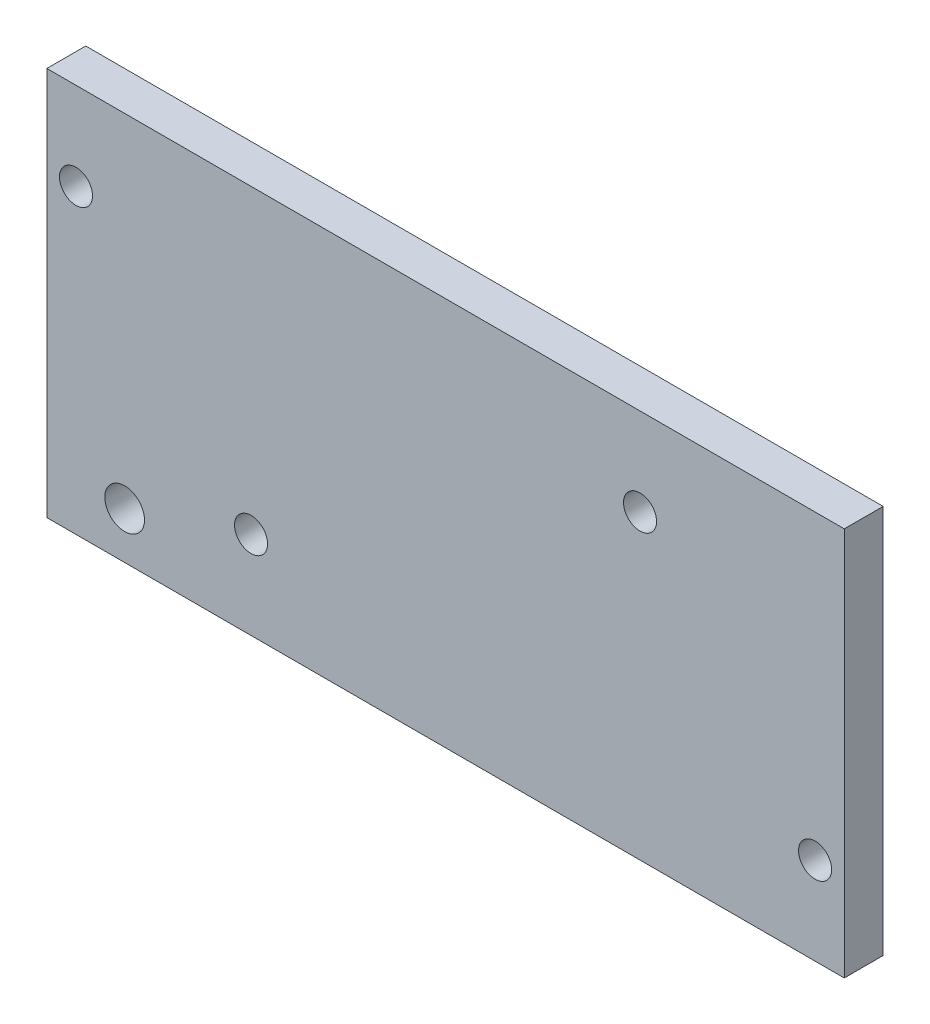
ISO-10303-21;
HEADER;
FILE_DESCRIPTION(('STEP AP214'),'2;1');
FILE_NAME('part.step','',(''),(''),'','','');
FILE_SCHEMA(('AUTOMOTIVE_DESIGN { 1 0 10303 214 1 1 1 1 }'));
ENDSEC;
DATA;
#1=APPLICATION_CONTEXT('core data for automotive mechanical design processes');
#2=APPLICATION_PROTOCOL_DEFINITION('international standard','automotive_design',2000,#1);
#3=PRODUCT_CONTEXT('',#1,'mechanical');
#4=PRODUCT('Part','Part','',(#3));
#5=PRODUCT_RELATED_PRODUCT_CATEGORY('part','',(#4));
#6=PRODUCT_DEFINITION_FORMATION('','',#4);
#7=PRODUCT_DEFINITION_CONTEXT('part definition',#1,'design');
#8=PRODUCT_DEFINITION('design','',#6,#7);
#9=PRODUCT_DEFINITION_SHAPE('','',#8);
#10=(LENGTH_UNIT() NAMED_UNIT(*) SI_UNIT(.MILLI.,.METRE.));
#11=(NAMED_UNIT(*) PLANE_ANGLE_UNIT() SI_UNIT($,.RADIAN.));
#12=(NAMED_UNIT(*) SI_UNIT($,.STERADIAN.) SOLID_ANGLE_UNIT());
#13=UNCERTAINTY_MEASURE_WITH_UNIT(LENGTH_MEASURE(1.E-05),#10,'distance_accuracy_value','');
#14=(GEOMETRIC_REPRESENTATION_CONTEXT(3) GLOBAL_UNCERTAINTY_ASSIGNED_CONTEXT((#13)) GLOBAL_UNIT_ASSIGNED_CONTEXT((#10,
#11,#12)) REPRESENTATION_CONTEXT('',''));
#15=CARTESIAN_POINT('',(0.,0.,0.));
#16=DIRECTION('',(0.,0.,1.));
#17=DIRECTION('',(1.,0.,0.));
#18=AXIS2_PLACEMENT_3D('',#15,#16,#17);
#19=CARTESIAN_POINT('',(205.,0.,0.));
#20=DIRECTION('',(0.,0.,-1.));
#21=DIRECTION('',(-1.,0.,0.));
#22=AXIS2_PLACEMENT_3D('',#19,#20,#21);
#23=PLANE('',#22);
#24=CARTESIAN_POINT('',(20.,12.,0.));
#25=DIRECTION('',(0.,0.,1.));
#26=DIRECTION('',(1.,0.,0.));
#27=AXIS2_PLACEMENT_3D('',#24,#25,#26);
#28=CIRCLE('',#27,5.1);
#29=CARTESIAN_POINT('',(25.1,12.,0.));
#30=VERTEX_POINT('',#29);
#31=EDGE_CURVE('E151',#30,#30,#28,.T.);
#32=ORIENTED_EDGE('',*,*,#31,.F.);
#33=EDGE_LOOP('',(#32));
#34=FACE_BOUND('',#33,.T.);
#35=CARTESIAN_POINT('',(7.50000000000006,77.5,0.));
#36=DIRECTION('',(0.,0.,1.));
#37=DIRECTION('',(1.,0.,0.));
#38=AXIS2_PLACEMENT_3D('',#35,#36,#37);
#39=CIRCLE('',#38,4.25);
#40=CARTESIAN_POINT('',(11.7500000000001,77.5,0.));
#41=VERTEX_POINT('',#40);
#42=EDGE_CURVE('E155',#41,#41,#39,.T.);
#43=ORIENTED_EDGE('',*,*,#42,.F.);
#44=EDGE_LOOP('',(#43));
#45=FACE_BOUND('',#44,.T.);
#46=CARTESIAN_POINT('',(152.5,77.5,0.));
#47=DIRECTION('',(0.,0.,1.));
#48=DIRECTION('',(1.,0.,0.));
#49=AXIS2_PLACEMENT_3D('',#46,#47,#48);
#50=CIRCLE('',#49,4.25);
#51=CARTESIAN_POINT('',(156.75,77.5,0.));
#52=VERTEX_POINT('',#51);
#53=EDGE_CURVE('E159',#52,#52,#50,.T.);
#54=ORIENTED_EDGE('',*,*,#53,.F.);
#55=EDGE_LOOP('',(#54));
#56=FACE_BOUND('',#55,.T.);
#57=CARTESIAN_POINT('',(52.5,22.5,0.));
#58=DIRECTION('',(0.,0.,1.));
#59=DIRECTION('',(1.,0.,0.));
#60=AXIS2_PLACEMENT_3D('',#57,#58,#59);
#61=CIRCLE('',#60,4.25);
#62=CARTESIAN_POINT('',(56.75,22.5,0.));
#63=VERTEX_POINT('',#62);
#64=EDGE_CURVE('E163',#63,#63,#61,.T.);
#65=ORIENTED_EDGE('',*,*,#64,.F.);
#66=EDGE_LOOP('',(#65));
#67=FACE_BOUND('',#66,.T.);
#68=CARTESIAN_POINT('',(197.5,22.5,0.));
#69=DIRECTION('',(0.,0.,1.));
#70=DIRECTION('',(1.,0.,0.));
#71=AXIS2_PLACEMENT_3D('',#68,#69,#70);
#72=CIRCLE('',#71,4.25);
#73=CARTESIAN_POINT('',(201.75,22.5,0.));
#74=VERTEX_POINT('',#73);
#75=EDGE_CURVE('E100',#74,#74,#72,.T.);
#76=ORIENTED_EDGE('',*,*,#75,.F.);
#77=EDGE_LOOP('',(#76));
#78=FACE_BOUND('',#77,.T.);
#79=DIRECTION('',(0.,-1.,0.));
#80=VECTOR('',#79,1.);
#81=CARTESIAN_POINT('',(0.,0.,0.));
#82=LINE('',#81,#80);
#83=CARTESIAN_POINT('',(0.,100.,9.43689570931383E-13));
#84=VERTEX_POINT('',#83);
#85=CARTESIAN_POINT('',(0.,0.,0.));
#86=VERTEX_POINT('',#85);
#87=EDGE_CURVE('E85',#84,#86,#82,.T.);
#88=ORIENTED_EDGE('',*,*,#87,.T.);
#89=DIRECTION('',(-1.,0.,0.));
#90=VECTOR('',#89,1.);
#91=CARTESIAN_POINT('',(205.,0.,0.));
#92=LINE('',#91,#90);
#93=CARTESIAN_POINT('',(205.,0.,0.));
#94=VERTEX_POINT('',#93);
#95=EDGE_CURVE('E11',#94,#86,#92,.T.);
#96=ORIENTED_EDGE('',*,*,#95,.F.);
#97=DIRECTION('',(0.,-1.,0.));
#98=VECTOR('',#97,1.);
#99=CARTESIAN_POINT('',(205.,0.,0.));
#100=LINE('',#99,#98);
#101=CARTESIAN_POINT('',(205.,100.,0.));
#102=VERTEX_POINT('',#101);
#103=EDGE_CURVE('E115',#102,#94,#100,.T.);
#104=ORIENTED_EDGE('',*,*,#103,.F.);
#105=DIRECTION('',(-1.,0.,0.));
#106=VECTOR('',#105,1.);
#107=CARTESIAN_POINT('',(205.,100.,0.));
#108=LINE('',#107,#106);
#109=EDGE_CURVE('E98',#102,#84,#108,.T.);
#110=ORIENTED_EDGE('',*,*,#109,.T.);
#111=EDGE_LOOP('',(#88,#96,#104,#110));
#112=FACE_BOUND('',#111,.T.);
#113=ADVANCED_FACE('F40',(#34,#45,#56,#67,#78,#112),#23,.F.);
#114=CARTESIAN_POINT('',(205.,0.,0.));
#115=DIRECTION('',(0.,1.,0.));
#116=DIRECTION('',(0.,0.,1.));
#117=AXIS2_PLACEMENT_3D('',#114,#115,#116);
#118=PLANE('',#117);
#119=DIRECTION('',(0.,0.,-1.));
#120=VECTOR('',#119,1.);
#121=CARTESIAN_POINT('',(0.,0.,0.));
#122=LINE('',#121,#120);
#123=CARTESIAN_POINT('',(0.,-9.43689570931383E-13,-10.));
#124=VERTEX_POINT('',#123);
#125=EDGE_CURVE('E81',#86,#124,#122,.T.);
#126=ORIENTED_EDGE('',*,*,#125,.T.);
#127=DIRECTION('',(-1.,0.,0.));
#128=VECTOR('',#127,1.);
#129=CARTESIAN_POINT('',(205.,-9.43689570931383E-13,-10.));
#130=LINE('',#129,#128);
#131=CARTESIAN_POINT('',(205.,-9.43689570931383E-13,-10.));
#132=VERTEX_POINT('',#131);
#133=EDGE_CURVE('E48',#132,#124,#130,.T.);
#134=ORIENTED_EDGE('',*,*,#133,.F.);
#135=DIRECTION('',(0.,0.,-1.));
#136=VECTOR('',#135,1.);
#137=CARTESIAN_POINT('',(205.,0.,0.));
#138=LINE('',#137,#136);
#139=EDGE_CURVE('E94',#94,#132,#138,.T.);
#140=ORIENTED_EDGE('',*,*,#139,.F.);
#141=ORIENTED_EDGE('',*,*,#95,.T.);
#142=EDGE_LOOP('',(#126,#134,#140,#141));
#143=FACE_BOUND('',#142,.T.);
#144=ADVANCED_FACE('F93',(#143),#118,.F.);
#145=CARTESIAN_POINT('',(205.,-9.43689570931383E-13,-10.));
#146=DIRECTION('',(0.,0.,1.));
#147=DIRECTION('',(1.,0.,0.));
#148=AXIS2_PLACEMENT_3D('',#145,#146,#147);
#149=PLANE('',#148);
#150=CARTESIAN_POINT('',(20.,11.9999999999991,-10.));
#151=DIRECTION('',(0.,0.,1.));
#152=DIRECTION('',(1.,0.,0.));
#153=AXIS2_PLACEMENT_3D('',#150,#151,#152);
#154=CIRCLE('',#153,5.1);
#155=CARTESIAN_POINT('',(25.1,11.9999999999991,-10.));
#156=VERTEX_POINT('',#155);
#157=EDGE_CURVE('E193',#156,#156,#154,.T.);
#158=ORIENTED_EDGE('',*,*,#157,.T.);
#159=EDGE_LOOP('',(#158));
#160=FACE_BOUND('',#159,.T.);
#161=CARTESIAN_POINT('',(7.49999999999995,77.5,-10.));
#162=DIRECTION('',(0.,0.,1.));
#163=DIRECTION('',(1.,0.,0.));
#164=AXIS2_PLACEMENT_3D('',#161,#162,#163);
#165=CIRCLE('',#164,4.25);
#166=CARTESIAN_POINT('',(11.75,77.5,-10.));
#167=VERTEX_POINT('',#166);
#168=EDGE_CURVE('E194',#167,#167,#165,.T.);
#169=ORIENTED_EDGE('',*,*,#168,.T.);
#170=EDGE_LOOP('',(#169));
#171=FACE_BOUND('',#170,.T.);
#172=CARTESIAN_POINT('',(152.5,77.5,-10.));
#173=DIRECTION('',(0.,0.,1.));
#174=DIRECTION('',(1.,0.,0.));
#175=AXIS2_PLACEMENT_3D('',#172,#173,#174);
#176=CIRCLE('',#175,4.25);
#177=CARTESIAN_POINT('',(156.75,77.5,-10.));
#178=VERTEX_POINT('',#177);
#179=EDGE_CURVE('E204',#178,#178,#176,.T.);
#180=ORIENTED_EDGE('',*,*,#179,.T.);
#181=EDGE_LOOP('',(#180));
#182=FACE_BOUND('',#181,.T.);
#183=CARTESIAN_POINT('',(52.5,22.4999999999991,-9.99999999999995));
#184=DIRECTION('',(0.,0.,1.));
#185=DIRECTION('',(1.,0.,0.));
#186=AXIS2_PLACEMENT_3D('',#183,#184,#185);
#187=CIRCLE('',#186,4.25);
#188=CARTESIAN_POINT('',(56.75,22.4999999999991,-9.99999999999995));
#189=VERTEX_POINT('',#188);
#190=EDGE_CURVE('E210',#189,#189,#187,.T.);
#191=ORIENTED_EDGE('',*,*,#190,.T.);
#192=EDGE_LOOP('',(#191));
#193=FACE_BOUND('',#192,.T.);
#194=CARTESIAN_POINT('',(197.5,22.4999999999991,-10.));
#195=DIRECTION('',(0.,0.,1.));
#196=DIRECTION('',(1.,0.,0.));
#197=AXIS2_PLACEMENT_3D('',#194,#195,#196);
#198=CIRCLE('',#197,4.25);
#199=CARTESIAN_POINT('',(201.75,22.4999999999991,-10.));
#200=VERTEX_POINT('',#199);
#201=EDGE_CURVE('E106',#200,#200,#198,.T.);
#202=ORIENTED_EDGE('',*,*,#201,.T.);
#203=EDGE_LOOP('',(#202));
#204=FACE_BOUND('',#203,.T.);
#205=DIRECTION('',(0.,1.,0.));
#206=VECTOR('',#205,1.);
#207=CARTESIAN_POINT('',(0.,-9.43689570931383E-13,-10.));
#208=LINE('',#207,#206);
#209=CARTESIAN_POINT('',(0.,99.9999999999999,-9.99999999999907));
#210=VERTEX_POINT('',#209);
#211=EDGE_CURVE('E86',#124,#210,#208,.T.);
#212=ORIENTED_EDGE('',*,*,#211,.T.);
#213=DIRECTION('',(-1.,0.,0.));
#214=VECTOR('',#213,1.);
#215=CARTESIAN_POINT('',(205.,99.9999999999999,-10.));
#216=LINE('',#215,#214);
#217=CARTESIAN_POINT('',(205.,99.9999999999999,-10.));
#218=VERTEX_POINT('',#217);
#219=EDGE_CURVE('E124',#218,#210,#216,.T.);
#220=ORIENTED_EDGE('',*,*,#219,.F.);
#221=DIRECTION('',(0.,1.,0.));
#222=VECTOR('',#221,1.);
#223=CARTESIAN_POINT('',(205.,-9.43689570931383E-13,-10.));
#224=LINE('',#223,#222);
#225=EDGE_CURVE('E60',#132,#218,#224,.T.);
#226=ORIENTED_EDGE('',*,*,#225,.F.);
#227=ORIENTED_EDGE('',*,*,#133,.T.);
#228=EDGE_LOOP('',(#212,#220,#226,#227));
#229=FACE_BOUND('',#228,.T.);
#230=ADVANCED_FACE('F130',(#160,#171,#182,#193,#204,#229),#149,.F.);
#231=CARTESIAN_POINT('',(205.,100.,0.));
#232=DIRECTION('',(0.,-1.,0.));
#233=DIRECTION('',(0.,0.,-1.));
#234=AXIS2_PLACEMENT_3D('',#231,#232,#233);
#235=PLANE('',#234);
#236=DIRECTION('',(0.,0.,1.));
#237=VECTOR('',#236,1.);
#238=CARTESIAN_POINT('',(0.,100.,9.43689570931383E-13));
#239=LINE('',#238,#237);
#240=EDGE_CURVE('E112',#210,#84,#239,.T.);
#241=ORIENTED_EDGE('',*,*,#240,.T.);
#242=ORIENTED_EDGE('',*,*,#109,.F.);
#243=DIRECTION('',(0.,0.,1.));
#244=VECTOR('',#243,1.);
#245=CARTESIAN_POINT('',(205.,100.,0.));
#246=LINE('',#245,#244);
#247=EDGE_CURVE('E55',#218,#102,#246,.T.);
#248=ORIENTED_EDGE('',*,*,#247,.F.);
#249=ORIENTED_EDGE('',*,*,#219,.T.);
#250=EDGE_LOOP('',(#241,#242,#248,#249));
#251=FACE_BOUND('',#250,.T.);
#252=ADVANCED_FACE('F132',(#251),#235,.F.);
#253=CARTESIAN_POINT('',(205.,100.,0.));
#254=DIRECTION('',(-1.,0.,0.));
#255=DIRECTION('',(0.,0.,1.));
#256=AXIS2_PLACEMENT_3D('',#253,#254,#255);
#257=PLANE('',#256);
#258=ORIENTED_EDGE('',*,*,#103,.T.);
#259=ORIENTED_EDGE('',*,*,#139,.T.);
#260=ORIENTED_EDGE('',*,*,#225,.T.);
#261=ORIENTED_EDGE('',*,*,#247,.T.);
#262=EDGE_LOOP('',(#258,#259,#260,#261));
#263=FACE_BOUND('',#262,.T.);
#264=ADVANCED_FACE('F133',(#263),#257,.F.);
#265=CARTESIAN_POINT('',(0.,100.,9.43689570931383E-13));
#266=DIRECTION('',(-1.,0.,0.));
#267=DIRECTION('',(0.,0.,1.));
#268=AXIS2_PLACEMENT_3D('',#265,#266,#267);
#269=PLANE('',#268);
#270=ORIENTED_EDGE('',*,*,#87,.F.);
#271=ORIENTED_EDGE('',*,*,#240,.F.);
#272=ORIENTED_EDGE('',*,*,#211,.F.);
#273=ORIENTED_EDGE('',*,*,#125,.F.);
#274=EDGE_LOOP('',(#270,#271,#272,#273));
#275=FACE_BOUND('',#274,.T.);
#276=ADVANCED_FACE('F82',(#275),#269,.T.);
#277=CARTESIAN_POINT('',(197.5,22.5,0.));
#278=DIRECTION('',(0.,0.,1.));
#279=DIRECTION('',(1.,0.,0.));
#280=AXIS2_PLACEMENT_3D('',#277,#278,#279);
#281=CYLINDRICAL_SURFACE('',#280,4.25);
#282=ORIENTED_EDGE('',*,*,#201,.F.);
#283=EDGE_LOOP('',(#282));
#284=FACE_BOUND('',#283,.T.);
#285=ORIENTED_EDGE('',*,*,#75,.T.);
#286=EDGE_LOOP('',(#285));
#287=FACE_BOUND('',#286,.T.);
#288=ADVANCED_FACE('F140',(#284,#287),#281,.F.);
#289=CARTESIAN_POINT('',(52.5,22.5,0.));
#290=DIRECTION('',(0.,0.,1.));
#291=DIRECTION('',(1.,0.,0.));
#292=AXIS2_PLACEMENT_3D('',#289,#290,#291);
#293=CYLINDRICAL_SURFACE('',#292,4.25);
#294=ORIENTED_EDGE('',*,*,#190,.F.);
#295=EDGE_LOOP('',(#294));
#296=FACE_BOUND('',#295,.T.);
#297=ORIENTED_EDGE('',*,*,#64,.T.);
#298=EDGE_LOOP('',(#297));
#299=FACE_BOUND('',#298,.T.);
#300=ADVANCED_FACE('F167',(#296,#299),#293,.F.);
#301=CARTESIAN_POINT('',(152.5,77.5,0.));
#302=DIRECTION('',(0.,0.,1.));
#303=DIRECTION('',(1.,0.,0.));
#304=AXIS2_PLACEMENT_3D('',#301,#302,#303);
#305=CYLINDRICAL_SURFACE('',#304,4.25);
#306=ORIENTED_EDGE('',*,*,#179,.F.);
#307=EDGE_LOOP('',(#306));
#308=FACE_BOUND('',#307,.T.);
#309=ORIENTED_EDGE('',*,*,#53,.T.);
#310=EDGE_LOOP('',(#309));
#311=FACE_BOUND('',#310,.T.);
#312=ADVANCED_FACE('F173',(#308,#311),#305,.F.);
#313=CARTESIAN_POINT('',(7.50000000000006,77.5,0.));
#314=DIRECTION('',(0.,0.,1.));
#315=DIRECTION('',(1.,0.,0.));
#316=AXIS2_PLACEMENT_3D('',#313,#314,#315);
#317=CYLINDRICAL_SURFACE('',#316,4.25);
#318=ORIENTED_EDGE('',*,*,#168,.F.);
#319=EDGE_LOOP('',(#318));
#320=FACE_BOUND('',#319,.T.);
#321=ORIENTED_EDGE('',*,*,#42,.T.);
#322=EDGE_LOOP('',(#321));
#323=FACE_BOUND('',#322,.T.);
#324=ADVANCED_FACE('F180',(#320,#323),#317,.F.);
#325=CARTESIAN_POINT('',(20.,12.,0.));
#326=DIRECTION('',(0.,0.,1.));
#327=DIRECTION('',(1.,0.,0.));
#328=AXIS2_PLACEMENT_3D('',#325,#326,#327);
#329=CYLINDRICAL_SURFACE('',#328,5.1);
#330=ORIENTED_EDGE('',*,*,#157,.F.);
#331=EDGE_LOOP('',(#330));
#332=FACE_BOUND('',#331,.T.);
#333=ORIENTED_EDGE('',*,*,#31,.T.);
#334=EDGE_LOOP('',(#333));
#335=FACE_BOUND('',#334,.T.);
#336=ADVANCED_FACE('F184',(#332,#335),#329,.F.);
#337=CLOSED_SHELL('',(#113,#144,#230,#252,#264,#276,#288,#300,#312,#324,#336));
#338=MANIFOLD_SOLID_BREP('B2',#337);
#339=ADVANCED_BREP_SHAPE_REPRESENTATION('',(#18,#338),#14);
#340=SHAPE_DEFINITION_REPRESENTATION(#9,#339);
ENDSEC;
END-ISO-10303-21;
